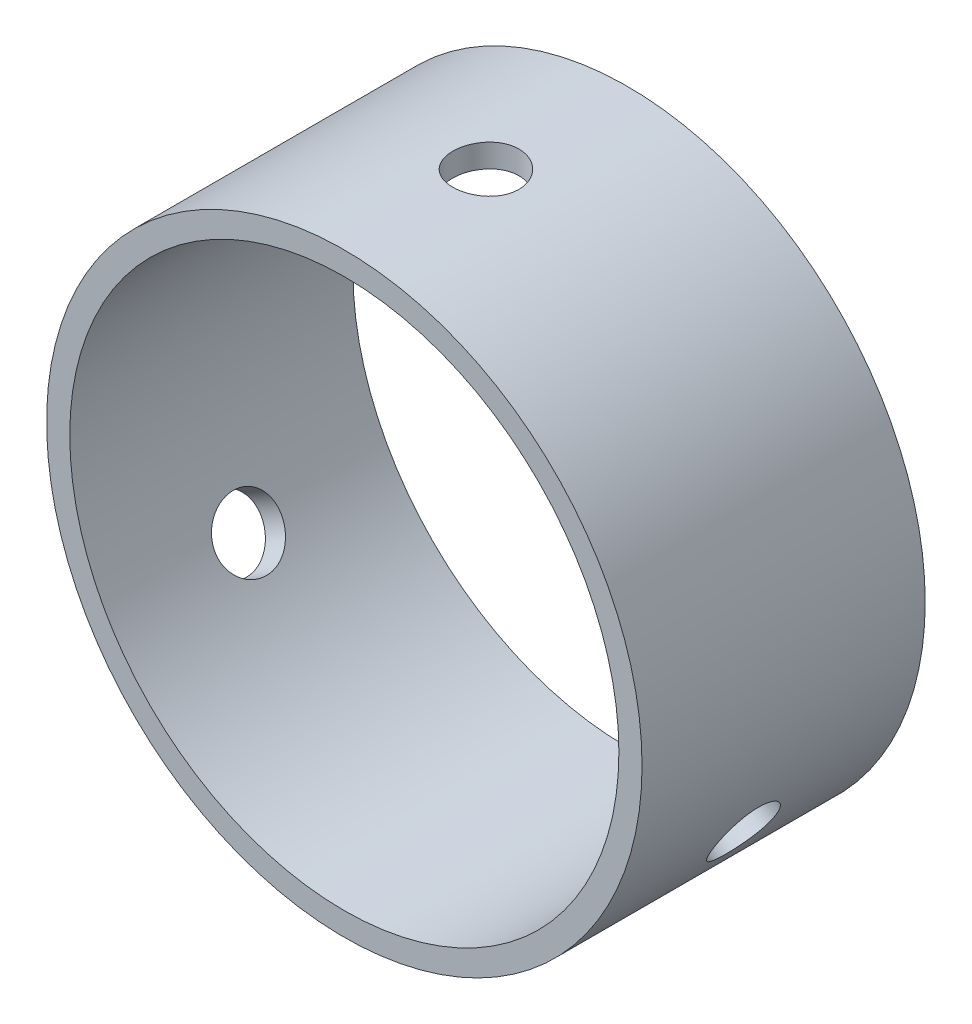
from build123d import *

# Parameters (mm, degrees)
SKETCH1_R               = 57.15
SKETCH1_R_2             = 52.705
EXTRUDE1_DEPTH          = 27.178
CUT_EXTRUDE1_REACH      = 132.649
CUT_EXTRUDE1_END_RADIUS = 52.705
SKETCH2_R               = 6.35
CIRPATTERN1_COUNT       = 3


with BuildPart() as part:
    # Sketch1 → Extrude1 (new, symmetric)
    with BuildSketch(Plane.XY):
        Circle(SKETCH1_R)
        Circle(SKETCH1_R_2, mode=Mode.SUBTRACT)
    extrude(amount=EXTRUDE1_DEPTH, both=True)

    # Cut-Extrude1: up to this cylinder (the profile starts outside it)
    cut_extrude1_end = Plane(origin=(0, 0, 0), z_dir=(0, 0, -1)) * Cylinder(CUT_EXTRUDE1_END_RADIUS, 371.708, mode=Mode.PRIVATE)
    # Sketch2 → Cut-Extrude1 (cut, up to the surface)
    with BuildSketch(Plane(origin=(0, 57.15, 0), x_dir=(-1, 0, 0), z_dir=(0, 1, 0)), mode=Mode.PRIVATE) as cut_extrude1_sk1:
        with Locations(Location((0, 0, 0), (0, 0, 90))):
            Circle(SKETCH2_R)
    cut_extrude1_tool1 = extrude(cut_extrude1_sk1.sketch, amount=-CUT_EXTRUDE1_REACH, mode=Mode.PRIVATE) - cut_extrude1_end
    cut_extrude1 = cut_extrude1_tool1.solids().sort_by_distance((0, 57.15, 0))[0]
    add(cut_extrude1, mode=Mode.SUBTRACT)

    # CirPattern1: Cut-Extrude1 ×3 about axis
    cirpattern1_axis = Axis((0, 0, 27.178), (0, 0, -1))
    for i in range(1, CIRPATTERN1_COUNT):
        add(cut_extrude1.rotate(cirpattern1_axis, i * 360 / CIRPATTERN1_COUNT), mode=Mode.SUBTRACT)


solid = part.part
